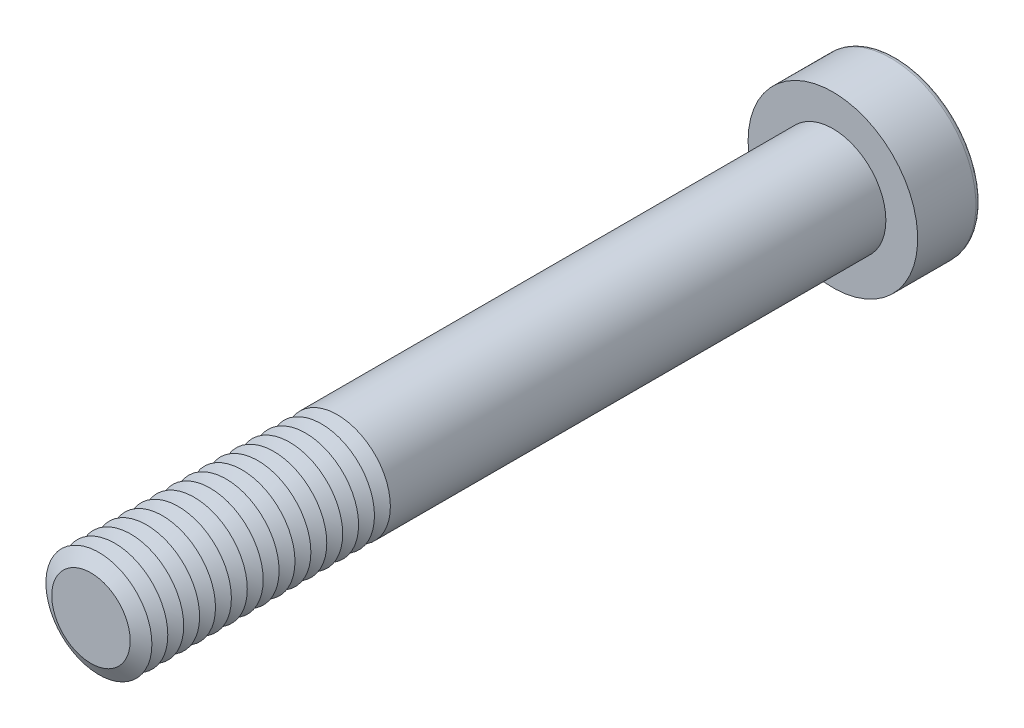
ISO-10303-21;
HEADER;
FILE_DESCRIPTION(('STEP AP214'),'2;1');
FILE_NAME('part.step','',(''),(''),'','','');
FILE_SCHEMA(('AUTOMOTIVE_DESIGN { 1 0 10303 214 1 1 1 1 }'));
ENDSEC;
DATA;
#1=APPLICATION_CONTEXT('core data for automotive mechanical design processes');
#2=APPLICATION_PROTOCOL_DEFINITION('international standard','automotive_design',2000,#1);
#3=PRODUCT_CONTEXT('',#1,'mechanical');
#4=PRODUCT('Part','Part','',(#3));
#5=PRODUCT_RELATED_PRODUCT_CATEGORY('part','',(#4));
#6=PRODUCT_DEFINITION_FORMATION('','',#4);
#7=PRODUCT_DEFINITION_CONTEXT('part definition',#1,'design');
#8=PRODUCT_DEFINITION('design','',#6,#7);
#9=PRODUCT_DEFINITION_SHAPE('','',#8);
#10=(LENGTH_UNIT() NAMED_UNIT(*) SI_UNIT(.MILLI.,.METRE.));
#11=(NAMED_UNIT(*) PLANE_ANGLE_UNIT() SI_UNIT($,.RADIAN.));
#12=(NAMED_UNIT(*) SI_UNIT($,.STERADIAN.) SOLID_ANGLE_UNIT());
#13=UNCERTAINTY_MEASURE_WITH_UNIT(LENGTH_MEASURE(1.E-05),#10,'distance_accuracy_value','');
#14=(GEOMETRIC_REPRESENTATION_CONTEXT(3) GLOBAL_UNCERTAINTY_ASSIGNED_CONTEXT((#13)) GLOBAL_UNIT_ASSIGNED_CONTEXT((#10,
#11,#12)) REPRESENTATION_CONTEXT('',''));
#15=CARTESIAN_POINT('',(0.,0.,0.));
#16=DIRECTION('',(0.,0.,1.));
#17=DIRECTION('',(1.,0.,0.));
#18=AXIS2_PLACEMENT_3D('',#15,#16,#17);
#19=CARTESIAN_POINT('',(0.,0.,64.75));
#20=DIRECTION('',(0.,0.,1.));
#21=DIRECTION('',(1.,0.,0.));
#22=AXIS2_PLACEMENT_3D('',#19,#20,#21);
#23=CONICAL_SURFACE('',#22,5.,1.0471975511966);
#24=CARTESIAN_POINT('',(0.,0.,64.));
#25=DIRECTION('',(0.,0.,1.));
#26=DIRECTION('',(1.,0.,0.));
#27=AXIS2_PLACEMENT_3D('',#24,#25,#26);
#28=CIRCLE('',#27,3.70096189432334);
#29=CARTESIAN_POINT('',(3.70096189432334,0.,64.));
#30=VERTEX_POINT('',#29);
#31=EDGE_CURVE('E313',#30,#30,#28,.T.);
#32=ORIENTED_EDGE('',*,*,#31,.T.);
#33=EDGE_LOOP('',(#32));
#34=FACE_BOUND('',#33,.T.);
#35=CARTESIAN_POINT('',(0.,0.,64.75));
#36=DIRECTION('',(0.,0.,1.));
#37=DIRECTION('',(1.,0.,0.));
#38=AXIS2_PLACEMENT_3D('',#35,#36,#37);
#39=CIRCLE('',#38,5.);
#40=CARTESIAN_POINT('',(5.,0.,64.75));
#41=VERTEX_POINT('',#40);
#42=EDGE_CURVE('E316',#41,#41,#39,.T.);
#43=ORIENTED_EDGE('',*,*,#42,.F.);
#44=EDGE_LOOP('',(#43));
#45=FACE_BOUND('',#44,.T.);
#46=ADVANCED_FACE('F39',(#34,#45),#23,.T.);
#47=CARTESIAN_POINT('',(0.,0.,64.));
#48=DIRECTION('',(0.,0.,-1.));
#49=DIRECTION('',(-1.,0.,0.));
#50=AXIS2_PLACEMENT_3D('',#47,#48,#49);
#51=CONICAL_SURFACE('',#50,3.70096189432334,1.0471975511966);
#52=CARTESIAN_POINT('',(0.,0.,63.25));
#53=DIRECTION('',(0.,0.,1.));
#54=DIRECTION('',(1.,0.,0.));
#55=AXIS2_PLACEMENT_3D('',#52,#53,#54);
#56=CIRCLE('',#55,5.);
#57=CARTESIAN_POINT('',(5.,0.,63.25));
#58=VERTEX_POINT('',#57);
#59=EDGE_CURVE('E324',#58,#58,#56,.T.);
#60=ORIENTED_EDGE('',*,*,#59,.T.);
#61=EDGE_LOOP('',(#60));
#62=FACE_BOUND('',#61,.T.);
#63=ORIENTED_EDGE('',*,*,#31,.F.);
#64=EDGE_LOOP('',(#63));
#65=FACE_BOUND('',#64,.T.);
#66=ADVANCED_FACE('F245',(#62,#65),#51,.T.);
#67=CARTESIAN_POINT('',(0.,0.,70.));
#68=DIRECTION('',(0.,0.,1.));
#69=DIRECTION('',(1.,0.,0.));
#70=AXIS2_PLACEMENT_3D('',#67,#68,#69);
#71=PLANE('',#70);
#72=CARTESIAN_POINT('',(0.,0.,70.));
#73=DIRECTION('',(0.,0.,1.));
#74=DIRECTION('',(1.,0.,0.));
#75=AXIS2_PLACEMENT_3D('',#72,#73,#74);
#76=CIRCLE('',#75,3.70096189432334);
#77=CARTESIAN_POINT('',(3.70096189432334,0.,70.));
#78=VERTEX_POINT('',#77);
#79=EDGE_CURVE('E174',#78,#78,#76,.T.);
#80=ORIENTED_EDGE('',*,*,#79,.T.);
#81=EDGE_LOOP('',(#80));
#82=FACE_BOUND('',#81,.T.);
#83=ADVANCED_FACE('F251',(#82),#71,.T.);
#84=CARTESIAN_POINT('',(0.,0.,70.));
#85=DIRECTION('',(0.,0.,-1.));
#86=DIRECTION('',(-1.,0.,0.));
#87=AXIS2_PLACEMENT_3D('',#84,#85,#86);
#88=CONICAL_SURFACE('',#87,3.70096189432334,1.0471975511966);
#89=CARTESIAN_POINT('',(0.,0.,69.25));
#90=DIRECTION('',(0.,0.,1.));
#91=DIRECTION('',(1.,0.,0.));
#92=AXIS2_PLACEMENT_3D('',#89,#90,#91);
#93=CIRCLE('',#92,5.);
#94=CARTESIAN_POINT('',(5.,0.,69.25));
#95=VERTEX_POINT('',#94);
#96=EDGE_CURVE('E291',#95,#95,#93,.T.);
#97=ORIENTED_EDGE('',*,*,#96,.T.);
#98=EDGE_LOOP('',(#97));
#99=FACE_BOUND('',#98,.T.);
#100=ORIENTED_EDGE('',*,*,#79,.F.);
#101=EDGE_LOOP('',(#100));
#102=FACE_BOUND('',#101,.T.);
#103=ADVANCED_FACE('F199',(#99,#102),#88,.T.);
#104=CARTESIAN_POINT('',(0.,0.,69.25));
#105=DIRECTION('',(0.,0.,1.));
#106=DIRECTION('',(1.,0.,0.));
#107=AXIS2_PLACEMENT_3D('',#104,#105,#106);
#108=CONICAL_SURFACE('',#107,5.,1.0471975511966);
#109=CARTESIAN_POINT('',(0.,0.,68.5));
#110=DIRECTION('',(0.,0.,1.));
#111=DIRECTION('',(1.,0.,0.));
#112=AXIS2_PLACEMENT_3D('',#109,#110,#111);
#113=CIRCLE('',#112,3.70096189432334);
#114=CARTESIAN_POINT('',(3.70096189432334,0.,68.5));
#115=VERTEX_POINT('',#114);
#116=EDGE_CURVE('E288',#115,#115,#113,.T.);
#117=ORIENTED_EDGE('',*,*,#116,.T.);
#118=EDGE_LOOP('',(#117));
#119=FACE_BOUND('',#118,.T.);
#120=ORIENTED_EDGE('',*,*,#96,.F.);
#121=EDGE_LOOP('',(#120));
#122=FACE_BOUND('',#121,.T.);
#123=ADVANCED_FACE('F277',(#119,#122),#108,.T.);
#124=CARTESIAN_POINT('',(0.,0.,68.5));
#125=DIRECTION('',(0.,0.,-1.));
#126=DIRECTION('',(-1.,0.,0.));
#127=AXIS2_PLACEMENT_3D('',#124,#125,#126);
#128=CONICAL_SURFACE('',#127,3.70096189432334,1.0471975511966);
#129=CARTESIAN_POINT('',(0.,0.,67.75));
#130=DIRECTION('',(0.,0.,1.));
#131=DIRECTION('',(1.,0.,0.));
#132=AXIS2_PLACEMENT_3D('',#129,#130,#131);
#133=CIRCLE('',#132,5.);
#134=CARTESIAN_POINT('',(5.,0.,67.75));
#135=VERTEX_POINT('',#134);
#136=EDGE_CURVE('E299',#135,#135,#133,.T.);
#137=ORIENTED_EDGE('',*,*,#136,.T.);
#138=EDGE_LOOP('',(#137));
#139=FACE_BOUND('',#138,.T.);
#140=ORIENTED_EDGE('',*,*,#116,.F.);
#141=EDGE_LOOP('',(#140));
#142=FACE_BOUND('',#141,.T.);
#143=ADVANCED_FACE('F274',(#139,#142),#128,.T.);
#144=CARTESIAN_POINT('',(0.,0.,67.75));
#145=DIRECTION('',(0.,0.,1.));
#146=DIRECTION('',(1.,0.,0.));
#147=AXIS2_PLACEMENT_3D('',#144,#145,#146);
#148=CONICAL_SURFACE('',#147,5.,1.0471975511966);
#149=CARTESIAN_POINT('',(0.,0.,67.));
#150=DIRECTION('',(0.,0.,1.));
#151=DIRECTION('',(1.,0.,0.));
#152=AXIS2_PLACEMENT_3D('',#149,#150,#151);
#153=CIRCLE('',#152,3.70096189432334);
#154=CARTESIAN_POINT('',(3.70096189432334,0.,67.));
#155=VERTEX_POINT('',#154);
#156=EDGE_CURVE('E293',#155,#155,#153,.T.);
#157=ORIENTED_EDGE('',*,*,#156,.T.);
#158=EDGE_LOOP('',(#157));
#159=FACE_BOUND('',#158,.T.);
#160=ORIENTED_EDGE('',*,*,#136,.F.);
#161=EDGE_LOOP('',(#160));
#162=FACE_BOUND('',#161,.T.);
#163=ADVANCED_FACE('F270',(#159,#162),#148,.T.);
#164=CARTESIAN_POINT('',(0.,0.,67.));
#165=DIRECTION('',(0.,0.,-1.));
#166=DIRECTION('',(-1.,0.,0.));
#167=AXIS2_PLACEMENT_3D('',#164,#165,#166);
#168=CONICAL_SURFACE('',#167,3.70096189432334,1.0471975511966);
#169=CARTESIAN_POINT('',(0.,0.,66.25));
#170=DIRECTION('',(0.,0.,1.));
#171=DIRECTION('',(1.,0.,0.));
#172=AXIS2_PLACEMENT_3D('',#169,#170,#171);
#173=CIRCLE('',#172,5.);
#174=CARTESIAN_POINT('',(5.,0.,66.25));
#175=VERTEX_POINT('',#174);
#176=EDGE_CURVE('E309',#175,#175,#173,.T.);
#177=ORIENTED_EDGE('',*,*,#176,.T.);
#178=EDGE_LOOP('',(#177));
#179=FACE_BOUND('',#178,.T.);
#180=ORIENTED_EDGE('',*,*,#156,.F.);
#181=EDGE_LOOP('',(#180));
#182=FACE_BOUND('',#181,.T.);
#183=ADVANCED_FACE('F266',(#179,#182),#168,.T.);
#184=CARTESIAN_POINT('',(0.,0.,66.25));
#185=DIRECTION('',(0.,0.,1.));
#186=DIRECTION('',(1.,0.,0.));
#187=AXIS2_PLACEMENT_3D('',#184,#185,#186);
#188=CONICAL_SURFACE('',#187,5.,1.0471975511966);
#189=CARTESIAN_POINT('',(0.,0.,65.5));
#190=DIRECTION('',(0.,0.,1.));
#191=DIRECTION('',(1.,0.,0.));
#192=AXIS2_PLACEMENT_3D('',#189,#190,#191);
#193=CIRCLE('',#192,3.70096189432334);
#194=CARTESIAN_POINT('',(3.70096189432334,0.,65.5));
#195=VERTEX_POINT('',#194);
#196=EDGE_CURVE('E305',#195,#195,#193,.T.);
#197=ORIENTED_EDGE('',*,*,#196,.T.);
#198=EDGE_LOOP('',(#197));
#199=FACE_BOUND('',#198,.T.);
#200=ORIENTED_EDGE('',*,*,#176,.F.);
#201=EDGE_LOOP('',(#200));
#202=FACE_BOUND('',#201,.T.);
#203=ADVANCED_FACE('F262',(#199,#202),#188,.T.);
#204=CARTESIAN_POINT('',(0.,0.,65.5));
#205=DIRECTION('',(0.,0.,-1.));
#206=DIRECTION('',(-1.,0.,0.));
#207=AXIS2_PLACEMENT_3D('',#204,#205,#206);
#208=CONICAL_SURFACE('',#207,3.70096189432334,1.0471975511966);
#209=ORIENTED_EDGE('',*,*,#42,.T.);
#210=EDGE_LOOP('',(#209));
#211=FACE_BOUND('',#210,.T.);
#212=ORIENTED_EDGE('',*,*,#196,.F.);
#213=EDGE_LOOP('',(#212));
#214=FACE_BOUND('',#213,.T.);
#215=ADVANCED_FACE('F258',(#211,#214),#208,.T.);
#216=CARTESIAN_POINT('',(0.,0.,63.25));
#217=DIRECTION('',(0.,0.,1.));
#218=DIRECTION('',(1.,0.,0.));
#219=AXIS2_PLACEMENT_3D('',#216,#217,#218);
#220=CONICAL_SURFACE('',#219,5.,1.0471975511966);
#221=CARTESIAN_POINT('',(0.,0.,62.5));
#222=DIRECTION('',(0.,0.,1.));
#223=DIRECTION('',(1.,0.,0.));
#224=AXIS2_PLACEMENT_3D('',#221,#222,#223);
#225=CIRCLE('',#224,3.70096189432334);
#226=CARTESIAN_POINT('',(3.70096189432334,0.,62.5));
#227=VERTEX_POINT('',#226);
#228=EDGE_CURVE('E320',#227,#227,#225,.T.);
#229=ORIENTED_EDGE('',*,*,#228,.T.);
#230=EDGE_LOOP('',(#229));
#231=FACE_BOUND('',#230,.T.);
#232=ORIENTED_EDGE('',*,*,#59,.F.);
#233=EDGE_LOOP('',(#232));
#234=FACE_BOUND('',#233,.T.);
#235=ADVANCED_FACE('F261',(#231,#234),#220,.T.);
#236=CARTESIAN_POINT('',(0.,0.,62.5));
#237=DIRECTION('',(0.,0.,-1.));
#238=DIRECTION('',(-1.,0.,0.));
#239=AXIS2_PLACEMENT_3D('',#236,#237,#238);
#240=CONICAL_SURFACE('',#239,3.70096189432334,1.0471975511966);
#241=CARTESIAN_POINT('',(0.,0.,61.75));
#242=DIRECTION('',(0.,0.,1.));
#243=DIRECTION('',(1.,0.,0.));
#244=AXIS2_PLACEMENT_3D('',#241,#242,#243);
#245=CIRCLE('',#244,5.);
#246=CARTESIAN_POINT('',(5.,0.,61.75));
#247=VERTEX_POINT('',#246);
#248=EDGE_CURVE('E332',#247,#247,#245,.T.);
#249=ORIENTED_EDGE('',*,*,#248,.T.);
#250=EDGE_LOOP('',(#249));
#251=FACE_BOUND('',#250,.T.);
#252=ORIENTED_EDGE('',*,*,#228,.F.);
#253=EDGE_LOOP('',(#252));
#254=FACE_BOUND('',#253,.T.);
#255=ADVANCED_FACE('F496',(#251,#254),#240,.T.);
#256=CARTESIAN_POINT('',(0.,0.,61.75));
#257=DIRECTION('',(0.,0.,1.));
#258=DIRECTION('',(1.,0.,0.));
#259=AXIS2_PLACEMENT_3D('',#256,#257,#258);
#260=CONICAL_SURFACE('',#259,5.,1.0471975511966);
#261=CARTESIAN_POINT('',(0.,0.,61.));
#262=DIRECTION('',(0.,0.,1.));
#263=DIRECTION('',(1.,0.,0.));
#264=AXIS2_PLACEMENT_3D('',#261,#262,#263);
#265=CIRCLE('',#264,3.70096189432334);
#266=CARTESIAN_POINT('',(3.70096189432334,0.,61.));
#267=VERTEX_POINT('',#266);
#268=EDGE_CURVE('E328',#267,#267,#265,.T.);
#269=ORIENTED_EDGE('',*,*,#268,.T.);
#270=EDGE_LOOP('',(#269));
#271=FACE_BOUND('',#270,.T.);
#272=ORIENTED_EDGE('',*,*,#248,.F.);
#273=EDGE_LOOP('',(#272));
#274=FACE_BOUND('',#273,.T.);
#275=ADVANCED_FACE('F492',(#271,#274),#260,.T.);
#276=CARTESIAN_POINT('',(0.,0.,61.));
#277=DIRECTION('',(0.,0.,-1.));
#278=DIRECTION('',(-1.,0.,0.));
#279=AXIS2_PLACEMENT_3D('',#276,#277,#278);
#280=CONICAL_SURFACE('',#279,3.70096189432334,1.0471975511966);
#281=CARTESIAN_POINT('',(0.,0.,60.25));
#282=DIRECTION('',(0.,0.,1.));
#283=DIRECTION('',(1.,0.,0.));
#284=AXIS2_PLACEMENT_3D('',#281,#282,#283);
#285=CIRCLE('',#284,5.);
#286=CARTESIAN_POINT('',(5.,0.,60.25));
#287=VERTEX_POINT('',#286);
#288=EDGE_CURVE('E340',#287,#287,#285,.T.);
#289=ORIENTED_EDGE('',*,*,#288,.T.);
#290=EDGE_LOOP('',(#289));
#291=FACE_BOUND('',#290,.T.);
#292=ORIENTED_EDGE('',*,*,#268,.F.);
#293=EDGE_LOOP('',(#292));
#294=FACE_BOUND('',#293,.T.);
#295=ADVANCED_FACE('F488',(#291,#294),#280,.T.);
#296=CARTESIAN_POINT('',(0.,0.,60.25));
#297=DIRECTION('',(0.,0.,1.));
#298=DIRECTION('',(1.,0.,0.));
#299=AXIS2_PLACEMENT_3D('',#296,#297,#298);
#300=CONICAL_SURFACE('',#299,5.,1.0471975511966);
#301=CARTESIAN_POINT('',(0.,0.,59.5));
#302=DIRECTION('',(0.,0.,1.));
#303=DIRECTION('',(1.,0.,0.));
#304=AXIS2_PLACEMENT_3D('',#301,#302,#303);
#305=CIRCLE('',#304,3.70096189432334);
#306=CARTESIAN_POINT('',(3.70096189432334,0.,59.5));
#307=VERTEX_POINT('',#306);
#308=EDGE_CURVE('E336',#307,#307,#305,.T.);
#309=ORIENTED_EDGE('',*,*,#308,.T.);
#310=EDGE_LOOP('',(#309));
#311=FACE_BOUND('',#310,.T.);
#312=ORIENTED_EDGE('',*,*,#288,.F.);
#313=EDGE_LOOP('',(#312));
#314=FACE_BOUND('',#313,.T.);
#315=ADVANCED_FACE('F484',(#311,#314),#300,.T.);
#316=CARTESIAN_POINT('',(0.,0.,59.5));
#317=DIRECTION('',(0.,0.,-1.));
#318=DIRECTION('',(-1.,0.,0.));
#319=AXIS2_PLACEMENT_3D('',#316,#317,#318);
#320=CONICAL_SURFACE('',#319,3.70096189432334,1.0471975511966);
#321=CARTESIAN_POINT('',(0.,0.,58.75));
#322=DIRECTION('',(0.,0.,1.));
#323=DIRECTION('',(1.,0.,0.));
#324=AXIS2_PLACEMENT_3D('',#321,#322,#323);
#325=CIRCLE('',#324,5.);
#326=CARTESIAN_POINT('',(5.,0.,58.75));
#327=VERTEX_POINT('',#326);
#328=EDGE_CURVE('E347',#327,#327,#325,.T.);
#329=ORIENTED_EDGE('',*,*,#328,.T.);
#330=EDGE_LOOP('',(#329));
#331=FACE_BOUND('',#330,.T.);
#332=ORIENTED_EDGE('',*,*,#308,.F.);
#333=EDGE_LOOP('',(#332));
#334=FACE_BOUND('',#333,.T.);
#335=ADVANCED_FACE('F480',(#331,#334),#320,.T.);
#336=CARTESIAN_POINT('',(0.,0.,58.75));
#337=DIRECTION('',(0.,0.,1.));
#338=DIRECTION('',(1.,0.,0.));
#339=AXIS2_PLACEMENT_3D('',#336,#337,#338);
#340=CONICAL_SURFACE('',#339,5.,1.0471975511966);
#341=CARTESIAN_POINT('',(0.,0.,58.));
#342=DIRECTION('',(0.,0.,1.));
#343=DIRECTION('',(1.,0.,0.));
#344=AXIS2_PLACEMENT_3D('',#341,#342,#343);
#345=CIRCLE('',#344,3.70096189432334);
#346=CARTESIAN_POINT('',(3.70096189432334,0.,58.));
#347=VERTEX_POINT('',#346);
#348=EDGE_CURVE('E344',#347,#347,#345,.T.);
#349=ORIENTED_EDGE('',*,*,#348,.T.);
#350=EDGE_LOOP('',(#349));
#351=FACE_BOUND('',#350,.T.);
#352=ORIENTED_EDGE('',*,*,#328,.F.);
#353=EDGE_LOOP('',(#352));
#354=FACE_BOUND('',#353,.T.);
#355=ADVANCED_FACE('F476',(#351,#354),#340,.T.);
#356=CARTESIAN_POINT('',(0.,0.,58.));
#357=DIRECTION('',(0.,0.,-1.));
#358=DIRECTION('',(-1.,0.,0.));
#359=AXIS2_PLACEMENT_3D('',#356,#357,#358);
#360=CONICAL_SURFACE('',#359,3.70096189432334,1.0471975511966);
#361=CARTESIAN_POINT('',(0.,0.,57.25));
#362=DIRECTION('',(0.,0.,1.));
#363=DIRECTION('',(1.,0.,0.));
#364=AXIS2_PLACEMENT_3D('',#361,#362,#363);
#365=CIRCLE('',#364,5.);
#366=CARTESIAN_POINT('',(5.,0.,57.25));
#367=VERTEX_POINT('',#366);
#368=EDGE_CURVE('E355',#367,#367,#365,.T.);
#369=ORIENTED_EDGE('',*,*,#368,.T.);
#370=EDGE_LOOP('',(#369));
#371=FACE_BOUND('',#370,.T.);
#372=ORIENTED_EDGE('',*,*,#348,.F.);
#373=EDGE_LOOP('',(#372));
#374=FACE_BOUND('',#373,.T.);
#375=ADVANCED_FACE('F472',(#371,#374),#360,.T.);
#376=CARTESIAN_POINT('',(0.,0.,57.25));
#377=DIRECTION('',(0.,0.,1.));
#378=DIRECTION('',(1.,0.,0.));
#379=AXIS2_PLACEMENT_3D('',#376,#377,#378);
#380=CONICAL_SURFACE('',#379,5.,1.0471975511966);
#381=CARTESIAN_POINT('',(0.,0.,56.5));
#382=DIRECTION('',(0.,0.,1.));
#383=DIRECTION('',(1.,0.,0.));
#384=AXIS2_PLACEMENT_3D('',#381,#382,#383);
#385=CIRCLE('',#384,3.70096189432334);
#386=CARTESIAN_POINT('',(3.70096189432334,0.,56.5));
#387=VERTEX_POINT('',#386);
#388=EDGE_CURVE('E351',#387,#387,#385,.T.);
#389=ORIENTED_EDGE('',*,*,#388,.T.);
#390=EDGE_LOOP('',(#389));
#391=FACE_BOUND('',#390,.T.);
#392=ORIENTED_EDGE('',*,*,#368,.F.);
#393=EDGE_LOOP('',(#392));
#394=FACE_BOUND('',#393,.T.);
#395=ADVANCED_FACE('F468',(#391,#394),#380,.T.);
#396=CARTESIAN_POINT('',(0.,0.,56.5));
#397=DIRECTION('',(0.,0.,-1.));
#398=DIRECTION('',(-1.,0.,0.));
#399=AXIS2_PLACEMENT_3D('',#396,#397,#398);
#400=CONICAL_SURFACE('',#399,3.70096189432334,1.0471975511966);
#401=CARTESIAN_POINT('',(0.,0.,55.75));
#402=DIRECTION('',(0.,0.,1.));
#403=DIRECTION('',(1.,0.,0.));
#404=AXIS2_PLACEMENT_3D('',#401,#402,#403);
#405=CIRCLE('',#404,5.);
#406=CARTESIAN_POINT('',(5.,0.,55.75));
#407=VERTEX_POINT('',#406);
#408=EDGE_CURVE('E363',#407,#407,#405,.T.);
#409=ORIENTED_EDGE('',*,*,#408,.T.);
#410=EDGE_LOOP('',(#409));
#411=FACE_BOUND('',#410,.T.);
#412=ORIENTED_EDGE('',*,*,#388,.F.);
#413=EDGE_LOOP('',(#412));
#414=FACE_BOUND('',#413,.T.);
#415=ADVANCED_FACE('F464',(#411,#414),#400,.T.);
#416=CARTESIAN_POINT('',(0.,0.,55.75));
#417=DIRECTION('',(0.,0.,1.));
#418=DIRECTION('',(1.,0.,0.));
#419=AXIS2_PLACEMENT_3D('',#416,#417,#418);
#420=CONICAL_SURFACE('',#419,5.,1.0471975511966);
#421=CARTESIAN_POINT('',(0.,0.,55.));
#422=DIRECTION('',(0.,0.,1.));
#423=DIRECTION('',(1.,0.,0.));
#424=AXIS2_PLACEMENT_3D('',#421,#422,#423);
#425=CIRCLE('',#424,3.70096189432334);
#426=CARTESIAN_POINT('',(3.70096189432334,0.,55.));
#427=VERTEX_POINT('',#426);
#428=EDGE_CURVE('E359',#427,#427,#425,.T.);
#429=ORIENTED_EDGE('',*,*,#428,.T.);
#430=EDGE_LOOP('',(#429));
#431=FACE_BOUND('',#430,.T.);
#432=ORIENTED_EDGE('',*,*,#408,.F.);
#433=EDGE_LOOP('',(#432));
#434=FACE_BOUND('',#433,.T.);
#435=ADVANCED_FACE('F460',(#431,#434),#420,.T.);
#436=CARTESIAN_POINT('',(0.,0.,55.));
#437=DIRECTION('',(0.,0.,-1.));
#438=DIRECTION('',(-1.,0.,0.));
#439=AXIS2_PLACEMENT_3D('',#436,#437,#438);
#440=CONICAL_SURFACE('',#439,3.70096189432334,1.0471975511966);
#441=CARTESIAN_POINT('',(0.,0.,54.25));
#442=DIRECTION('',(0.,0.,1.));
#443=DIRECTION('',(1.,0.,0.));
#444=AXIS2_PLACEMENT_3D('',#441,#442,#443);
#445=CIRCLE('',#444,5.);
#446=CARTESIAN_POINT('',(5.,0.,54.25));
#447=VERTEX_POINT('',#446);
#448=EDGE_CURVE('E371',#447,#447,#445,.T.);
#449=ORIENTED_EDGE('',*,*,#448,.T.);
#450=EDGE_LOOP('',(#449));
#451=FACE_BOUND('',#450,.T.);
#452=ORIENTED_EDGE('',*,*,#428,.F.);
#453=EDGE_LOOP('',(#452));
#454=FACE_BOUND('',#453,.T.);
#455=ADVANCED_FACE('F456',(#451,#454),#440,.T.);
#456=CARTESIAN_POINT('',(0.,0.,54.25));
#457=DIRECTION('',(0.,0.,1.));
#458=DIRECTION('',(1.,0.,0.));
#459=AXIS2_PLACEMENT_3D('',#456,#457,#458);
#460=CONICAL_SURFACE('',#459,5.,1.0471975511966);
#461=CARTESIAN_POINT('',(0.,0.,53.5));
#462=DIRECTION('',(0.,0.,1.));
#463=DIRECTION('',(1.,0.,0.));
#464=AXIS2_PLACEMENT_3D('',#461,#462,#463);
#465=CIRCLE('',#464,3.70096189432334);
#466=CARTESIAN_POINT('',(3.70096189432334,0.,53.5));
#467=VERTEX_POINT('',#466);
#468=EDGE_CURVE('E367',#467,#467,#465,.T.);
#469=ORIENTED_EDGE('',*,*,#468,.T.);
#470=EDGE_LOOP('',(#469));
#471=FACE_BOUND('',#470,.T.);
#472=ORIENTED_EDGE('',*,*,#448,.F.);
#473=EDGE_LOOP('',(#472));
#474=FACE_BOUND('',#473,.T.);
#475=ADVANCED_FACE('F452',(#471,#474),#460,.T.);
#476=CARTESIAN_POINT('',(0.,0.,53.5));
#477=DIRECTION('',(0.,0.,-1.));
#478=DIRECTION('',(-1.,0.,0.));
#479=AXIS2_PLACEMENT_3D('',#476,#477,#478);
#480=CONICAL_SURFACE('',#479,3.70096189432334,1.0471975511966);
#481=CARTESIAN_POINT('',(0.,0.,52.75));
#482=DIRECTION('',(0.,0.,1.));
#483=DIRECTION('',(1.,0.,0.));
#484=AXIS2_PLACEMENT_3D('',#481,#482,#483);
#485=CIRCLE('',#484,5.);
#486=CARTESIAN_POINT('',(5.,0.,52.75));
#487=VERTEX_POINT('',#486);
#488=EDGE_CURVE('E379',#487,#487,#485,.T.);
#489=ORIENTED_EDGE('',*,*,#488,.T.);
#490=EDGE_LOOP('',(#489));
#491=FACE_BOUND('',#490,.T.);
#492=ORIENTED_EDGE('',*,*,#468,.F.);
#493=EDGE_LOOP('',(#492));
#494=FACE_BOUND('',#493,.T.);
#495=ADVANCED_FACE('F448',(#491,#494),#480,.T.);
#496=CARTESIAN_POINT('',(0.,0.,52.75));
#497=DIRECTION('',(0.,0.,1.));
#498=DIRECTION('',(1.,0.,0.));
#499=AXIS2_PLACEMENT_3D('',#496,#497,#498);
#500=CONICAL_SURFACE('',#499,5.,1.0471975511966);
#501=CARTESIAN_POINT('',(0.,0.,52.));
#502=DIRECTION('',(0.,0.,1.));
#503=DIRECTION('',(1.,0.,0.));
#504=AXIS2_PLACEMENT_3D('',#501,#502,#503);
#505=CIRCLE('',#504,3.70096189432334);
#506=CARTESIAN_POINT('',(3.70096189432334,0.,52.));
#507=VERTEX_POINT('',#506);
#508=EDGE_CURVE('E375',#507,#507,#505,.T.);
#509=ORIENTED_EDGE('',*,*,#508,.T.);
#510=EDGE_LOOP('',(#509));
#511=FACE_BOUND('',#510,.T.);
#512=ORIENTED_EDGE('',*,*,#488,.F.);
#513=EDGE_LOOP('',(#512));
#514=FACE_BOUND('',#513,.T.);
#515=ADVANCED_FACE('F444',(#511,#514),#500,.T.);
#516=CARTESIAN_POINT('',(0.,0.,52.));
#517=DIRECTION('',(0.,0.,-1.));
#518=DIRECTION('',(-1.,0.,0.));
#519=AXIS2_PLACEMENT_3D('',#516,#517,#518);
#520=CONICAL_SURFACE('',#519,3.70096189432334,1.0471975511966);
#521=CARTESIAN_POINT('',(0.,0.,51.25));
#522=DIRECTION('',(0.,0.,1.));
#523=DIRECTION('',(1.,0.,0.));
#524=AXIS2_PLACEMENT_3D('',#521,#522,#523);
#525=CIRCLE('',#524,5.);
#526=CARTESIAN_POINT('',(5.,0.,51.25));
#527=VERTEX_POINT('',#526);
#528=EDGE_CURVE('E387',#527,#527,#525,.T.);
#529=ORIENTED_EDGE('',*,*,#528,.T.);
#530=EDGE_LOOP('',(#529));
#531=FACE_BOUND('',#530,.T.);
#532=ORIENTED_EDGE('',*,*,#508,.F.);
#533=EDGE_LOOP('',(#532));
#534=FACE_BOUND('',#533,.T.);
#535=ADVANCED_FACE('F440',(#531,#534),#520,.T.);
#536=CARTESIAN_POINT('',(0.,0.,51.25));
#537=DIRECTION('',(0.,0.,1.));
#538=DIRECTION('',(1.,0.,0.));
#539=AXIS2_PLACEMENT_3D('',#536,#537,#538);
#540=CONICAL_SURFACE('',#539,5.,1.0471975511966);
#541=CARTESIAN_POINT('',(0.,0.,50.5));
#542=DIRECTION('',(0.,0.,1.));
#543=DIRECTION('',(1.,0.,0.));
#544=AXIS2_PLACEMENT_3D('',#541,#542,#543);
#545=CIRCLE('',#544,3.70096189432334);
#546=CARTESIAN_POINT('',(3.70096189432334,0.,50.5));
#547=VERTEX_POINT('',#546);
#548=EDGE_CURVE('E383',#547,#547,#545,.T.);
#549=ORIENTED_EDGE('',*,*,#548,.T.);
#550=EDGE_LOOP('',(#549));
#551=FACE_BOUND('',#550,.T.);
#552=ORIENTED_EDGE('',*,*,#528,.F.);
#553=EDGE_LOOP('',(#552));
#554=FACE_BOUND('',#553,.T.);
#555=ADVANCED_FACE('F436',(#551,#554),#540,.T.);
#556=CARTESIAN_POINT('',(0.,0.,50.5));
#557=DIRECTION('',(0.,0.,-1.));
#558=DIRECTION('',(-1.,0.,0.));
#559=AXIS2_PLACEMENT_3D('',#556,#557,#558);
#560=CONICAL_SURFACE('',#559,3.70096189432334,1.0471975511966);
#561=CARTESIAN_POINT('',(0.,0.,49.75));
#562=DIRECTION('',(0.,0.,1.));
#563=DIRECTION('',(1.,0.,0.));
#564=AXIS2_PLACEMENT_3D('',#561,#562,#563);
#565=CIRCLE('',#564,5.);
#566=CARTESIAN_POINT('',(5.,0.,49.75));
#567=VERTEX_POINT('',#566);
#568=EDGE_CURVE('E395',#567,#567,#565,.T.);
#569=ORIENTED_EDGE('',*,*,#568,.T.);
#570=EDGE_LOOP('',(#569));
#571=FACE_BOUND('',#570,.T.);
#572=ORIENTED_EDGE('',*,*,#548,.F.);
#573=EDGE_LOOP('',(#572));
#574=FACE_BOUND('',#573,.T.);
#575=ADVANCED_FACE('F432',(#571,#574),#560,.T.);
#576=CARTESIAN_POINT('',(0.,0.,49.75));
#577=DIRECTION('',(0.,0.,1.));
#578=DIRECTION('',(1.,0.,0.));
#579=AXIS2_PLACEMENT_3D('',#576,#577,#578);
#580=CONICAL_SURFACE('',#579,5.,1.0471975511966);
#581=CARTESIAN_POINT('',(0.,0.,49.));
#582=DIRECTION('',(0.,0.,1.));
#583=DIRECTION('',(1.,0.,0.));
#584=AXIS2_PLACEMENT_3D('',#581,#582,#583);
#585=CIRCLE('',#584,3.70096189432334);
#586=CARTESIAN_POINT('',(3.70096189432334,0.,49.));
#587=VERTEX_POINT('',#586);
#588=EDGE_CURVE('E391',#587,#587,#585,.T.);
#589=ORIENTED_EDGE('',*,*,#588,.T.);
#590=EDGE_LOOP('',(#589));
#591=FACE_BOUND('',#590,.T.);
#592=ORIENTED_EDGE('',*,*,#568,.F.);
#593=EDGE_LOOP('',(#592));
#594=FACE_BOUND('',#593,.T.);
#595=ADVANCED_FACE('F427',(#591,#594),#580,.T.);
#596=CARTESIAN_POINT('',(0.,0.,49.));
#597=DIRECTION('',(0.,0.,-1.));
#598=DIRECTION('',(-1.,0.,0.));
#599=AXIS2_PLACEMENT_3D('',#596,#597,#598);
#600=CONICAL_SURFACE('',#599,3.70096189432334,1.0471975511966);
#601=CARTESIAN_POINT('',(0.,0.,48.25));
#602=DIRECTION('',(0.,0.,1.));
#603=DIRECTION('',(1.,0.,0.));
#604=AXIS2_PLACEMENT_3D('',#601,#602,#603);
#605=CIRCLE('',#604,5.);
#606=CARTESIAN_POINT('',(5.,0.,48.25));
#607=VERTEX_POINT('',#606);
#608=EDGE_CURVE('E407',#607,#607,#605,.T.);
#609=ORIENTED_EDGE('',*,*,#608,.T.);
#610=EDGE_LOOP('',(#609));
#611=FACE_BOUND('',#610,.T.);
#612=ORIENTED_EDGE('',*,*,#588,.F.);
#613=EDGE_LOOP('',(#612));
#614=FACE_BOUND('',#613,.T.);
#615=ADVANCED_FACE('F413',(#611,#614),#600,.T.);
#616=CARTESIAN_POINT('',(0.,0.,48.25));
#617=DIRECTION('',(0.,0.,1.));
#618=DIRECTION('',(1.,0.,0.));
#619=AXIS2_PLACEMENT_3D('',#616,#617,#618);
#620=CONICAL_SURFACE('',#619,5.,1.0471975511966);
#621=CARTESIAN_POINT('',(0.,0.,47.5));
#622=DIRECTION('',(0.,0.,1.));
#623=DIRECTION('',(1.,0.,0.));
#624=AXIS2_PLACEMENT_3D('',#621,#622,#623);
#625=CIRCLE('',#624,3.70096189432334);
#626=CARTESIAN_POINT('',(3.70096189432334,0.,47.5));
#627=VERTEX_POINT('',#626);
#628=EDGE_CURVE('E399',#627,#627,#625,.T.);
#629=ORIENTED_EDGE('',*,*,#628,.T.);
#630=EDGE_LOOP('',(#629));
#631=FACE_BOUND('',#630,.T.);
#632=ORIENTED_EDGE('',*,*,#608,.F.);
#633=EDGE_LOOP('',(#632));
#634=FACE_BOUND('',#633,.T.);
#635=ADVANCED_FACE('F416',(#631,#634),#620,.T.);
#636=CARTESIAN_POINT('',(0.,0.,47.5));
#637=DIRECTION('',(0.,0.,-1.));
#638=DIRECTION('',(-1.,0.,0.));
#639=AXIS2_PLACEMENT_3D('',#636,#637,#638);
#640=CONICAL_SURFACE('',#639,3.70096189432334,1.0471975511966);
#641=CARTESIAN_POINT('',(0.,0.,46.75));
#642=DIRECTION('',(0.,0.,1.));
#643=DIRECTION('',(1.,0.,0.));
#644=AXIS2_PLACEMENT_3D('',#641,#642,#643);
#645=CIRCLE('',#644,5.);
#646=CARTESIAN_POINT('',(5.,0.,46.75));
#647=VERTEX_POINT('',#646);
#648=EDGE_CURVE('E403',#647,#647,#645,.T.);
#649=ORIENTED_EDGE('',*,*,#648,.T.);
#650=EDGE_LOOP('',(#649));
#651=FACE_BOUND('',#650,.T.);
#652=ORIENTED_EDGE('',*,*,#628,.F.);
#653=EDGE_LOOP('',(#652));
#654=FACE_BOUND('',#653,.T.);
#655=ADVANCED_FACE('F418',(#651,#654),#640,.T.);
#656=CARTESIAN_POINT('',(0.,0.,-0.75));
#657=DIRECTION('',(0.,0.,-1.));
#658=DIRECTION('',(-1.,0.,0.));
#659=AXIS2_PLACEMENT_3D('',#656,#657,#658);
#660=CONICAL_SURFACE('',#659,3.5,1.0471975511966);
#661=CARTESIAN_POINT('',(0.,0.,1.27072594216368));
#662=VERTEX_POINT('',#661);
#663=VERTEX_LOOP('',#662);
#664=FACE_BOUND('',#663,.T.);
#665=CARTESIAN_POINT('',(0.,0.,-0.75));
#666=DIRECTION('',(0.,0.,-1.));
#667=DIRECTION('',(-1.,0.,0.));
#668=AXIS2_PLACEMENT_3D('',#665,#666,#667);
#669=CIRCLE('',#668,3.5);
#670=CARTESIAN_POINT('',(-3.03108891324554,1.75,-0.75));
#671=VERTEX_POINT('',#670);
#672=CARTESIAN_POINT('',(0.,3.5,-0.75));
#673=VERTEX_POINT('',#672);
#674=EDGE_CURVE('E149',#671,#673,#669,.T.);
#675=ORIENTED_EDGE('',*,*,#674,.T.);
#676=CARTESIAN_POINT('',(0.,0.,-0.75));
#677=DIRECTION('',(0.,0.,-1.));
#678=DIRECTION('',(-1.,0.,0.));
#679=AXIS2_PLACEMENT_3D('',#676,#677,#678);
#680=CIRCLE('',#679,3.5);
#681=CARTESIAN_POINT('',(3.03108891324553,1.75,-0.75));
#682=VERTEX_POINT('',#681);
#683=EDGE_CURVE('E54',#673,#682,#680,.T.);
#684=ORIENTED_EDGE('',*,*,#683,.T.);
#685=CARTESIAN_POINT('',(3.03108891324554,-1.75,-0.75));
#686=VERTEX_POINT('',#685);
#687=EDGE_CURVE('E996',#682,#686,#680,.T.);
#688=ORIENTED_EDGE('',*,*,#687,.T.);
#689=CARTESIAN_POINT('',(0.,-3.5,-0.75));
#690=VERTEX_POINT('',#689);
#691=EDGE_CURVE('E995',#686,#690,#680,.T.);
#692=ORIENTED_EDGE('',*,*,#691,.T.);
#693=CARTESIAN_POINT('',(-3.03108891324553,-1.75,-0.75));
#694=VERTEX_POINT('',#693);
#695=EDGE_CURVE('E990',#690,#694,#680,.T.);
#696=ORIENTED_EDGE('',*,*,#695,.T.);
#697=EDGE_CURVE('E988',#694,#671,#680,.T.);
#698=ORIENTED_EDGE('',*,*,#697,.T.);
#699=EDGE_LOOP('',(#675,#684,#688,#692,#696,#698));
#700=FACE_BOUND('',#699,.T.);
#701=ADVANCED_FACE('F201',(#664,#700),#660,.F.);
#702=CARTESIAN_POINT('',(0.,0.,-0.75));
#703=DIRECTION('',(0.,0.,-1.));
#704=DIRECTION('',(-1.,0.,0.));
#705=AXIS2_PLACEMENT_3D('',#702,#703,#704);
#706=PLANE('',#705);
#707=ORIENTED_EDGE('',*,*,#683,.F.);
#708=DIRECTION('',(1.,0.,0.));
#709=VECTOR('',#708,1.);
#710=CARTESIAN_POINT('',(-2.02072594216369,3.5,-0.75));
#711=LINE('',#710,#709);
#712=CARTESIAN_POINT('',(2.02072594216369,3.5,-0.75));
#713=VERTEX_POINT('',#712);
#714=EDGE_CURVE('E1038',#673,#713,#711,.T.);
#715=ORIENTED_EDGE('',*,*,#714,.T.);
#716=DIRECTION('',(0.5,-0.866025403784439,0.));
#717=VECTOR('',#716,1.);
#718=CARTESIAN_POINT('',(2.02072594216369,3.5,-0.75));
#719=LINE('',#718,#717);
#720=EDGE_CURVE('E155',#713,#682,#719,.T.);
#721=ORIENTED_EDGE('',*,*,#720,.T.);
#722=EDGE_LOOP('',(#707,#715,#721));
#723=FACE_BOUND('',#722,.T.);
#724=ADVANCED_FACE('F585',(#723),#706,.T.);
#725=ORIENTED_EDGE('',*,*,#687,.F.);
#726=CARTESIAN_POINT('',(4.04145188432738,0.,-0.75));
#727=VERTEX_POINT('',#726);
#728=EDGE_CURVE('E1034',#682,#727,#719,.T.);
#729=ORIENTED_EDGE('',*,*,#728,.T.);
#730=DIRECTION('',(-0.5,-0.866025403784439,0.));
#731=VECTOR('',#730,1.);
#732=CARTESIAN_POINT('',(4.04145188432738,0.,-0.75));
#733=LINE('',#732,#731);
#734=EDGE_CURVE('E1011',#727,#686,#733,.T.);
#735=ORIENTED_EDGE('',*,*,#734,.T.);
#736=EDGE_LOOP('',(#725,#729,#735));
#737=FACE_BOUND('',#736,.T.);
#738=ADVANCED_FACE('F595',(#737),#706,.T.);
#739=ORIENTED_EDGE('',*,*,#691,.F.);
#740=CARTESIAN_POINT('',(2.02072594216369,-3.5,-0.75));
#741=VERTEX_POINT('',#740);
#742=EDGE_CURVE('E1013',#686,#741,#733,.T.);
#743=ORIENTED_EDGE('',*,*,#742,.T.);
#744=DIRECTION('',(-1.,0.,0.));
#745=VECTOR('',#744,1.);
#746=CARTESIAN_POINT('',(2.02072594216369,-3.5,-0.75));
#747=LINE('',#746,#745);
#748=EDGE_CURVE('E962',#741,#690,#747,.T.);
#749=ORIENTED_EDGE('',*,*,#748,.T.);
#750=EDGE_LOOP('',(#739,#743,#749));
#751=FACE_BOUND('',#750,.T.);
#752=ADVANCED_FACE('F605',(#751),#706,.T.);
#753=ORIENTED_EDGE('',*,*,#695,.F.);
#754=CARTESIAN_POINT('',(-2.02072594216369,-3.5,-0.75));
#755=VERTEX_POINT('',#754);
#756=EDGE_CURVE('E1007',#690,#755,#747,.T.);
#757=ORIENTED_EDGE('',*,*,#756,.T.);
#758=DIRECTION('',(-0.5,0.866025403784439,0.));
#759=VECTOR('',#758,1.);
#760=CARTESIAN_POINT('',(-2.02072594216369,-3.5,-0.75));
#761=LINE('',#760,#759);
#762=EDGE_CURVE('E1009',#755,#694,#761,.T.);
#763=ORIENTED_EDGE('',*,*,#762,.T.);
#764=EDGE_LOOP('',(#753,#757,#763));
#765=FACE_BOUND('',#764,.T.);
#766=ADVANCED_FACE('F613',(#765),#706,.T.);
#767=ORIENTED_EDGE('',*,*,#697,.F.);
#768=CARTESIAN_POINT('',(-4.04145188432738,0.,-0.75));
#769=VERTEX_POINT('',#768);
#770=EDGE_CURVE('E1014',#694,#769,#761,.T.);
#771=ORIENTED_EDGE('',*,*,#770,.T.);
#772=DIRECTION('',(0.5,0.866025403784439,0.));
#773=VECTOR('',#772,1.);
#774=CARTESIAN_POINT('',(-4.04145188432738,0.,-0.75));
#775=LINE('',#774,#773);
#776=EDGE_CURVE('E158',#769,#671,#775,.T.);
#777=ORIENTED_EDGE('',*,*,#776,.T.);
#778=EDGE_LOOP('',(#767,#771,#777));
#779=FACE_BOUND('',#778,.T.);
#780=ADVANCED_FACE('F231',(#779),#706,.T.);
#781=ORIENTED_EDGE('',*,*,#674,.F.);
#782=CARTESIAN_POINT('',(-2.02072594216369,3.5,-0.75));
#783=VERTEX_POINT('',#782);
#784=EDGE_CURVE('E1021',#671,#783,#775,.T.);
#785=ORIENTED_EDGE('',*,*,#784,.T.);
#786=EDGE_CURVE('E1035',#783,#673,#711,.T.);
#787=ORIENTED_EDGE('',*,*,#786,.T.);
#788=EDGE_LOOP('',(#781,#785,#787));
#789=FACE_BOUND('',#788,.T.);
#790=ADVANCED_FACE('F597',(#789),#706,.T.);
#791=CARTESIAN_POINT('',(-2.02072594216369,3.5,-0.75));
#792=DIRECTION('',(0.,1.,0.));
#793=DIRECTION('',(-1.,0.,0.));
#794=AXIS2_PLACEMENT_3D('',#791,#792,#793);
#795=PLANE('',#794);
#796=DIRECTION('',(0.,0.,-1.));
#797=VECTOR('',#796,1.);
#798=CARTESIAN_POINT('',(-2.02072594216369,3.5,-0.75));
#799=LINE('',#798,#797);
#800=CARTESIAN_POINT('',(-2.02072594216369,3.5,-6.));
#801=VERTEX_POINT('',#800);
#802=EDGE_CURVE('E147',#783,#801,#799,.T.);
#803=ORIENTED_EDGE('',*,*,#802,.T.);
#804=CARTESIAN_POINT('',(-5.27521327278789,3.5,-6.613404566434));
#805=CARTESIAN_POINT('',(-5.11717138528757,3.5,-6.57812703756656));
#806=CARTESIAN_POINT('',(-4.95902873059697,3.5,-6.5432936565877));
#807=CARTESIAN_POINT('',(-4.64249233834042,3.5,-6.47475322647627));
#808=CARTESIAN_POINT('',(-4.48409858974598,3.5,-6.44104622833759));
#809=CARTESIAN_POINT('',(-4.16686075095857,3.5,-6.37496567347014));
#810=CARTESIAN_POINT('',(-4.00801636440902,3.5,-6.34259353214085));
#811=CARTESIAN_POINT('',(-3.68999232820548,3.5,-6.27954992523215));
#812=CARTESIAN_POINT('',(-3.53081268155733,3.5,-6.24887844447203));
#813=CARTESIAN_POINT('',(-3.05545711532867,3.5,-6.16049717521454));
#814=CARTESIAN_POINT('',(-2.73870333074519,3.5,-6.10583257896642));
#815=CARTESIAN_POINT('',(-2.10326379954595,3.5,-6.00899390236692));
#816=CARTESIAN_POINT('',(-1.78457845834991,3.5,-5.9668172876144));
#817=CARTESIAN_POINT('',(-1.30331397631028,3.5,-5.91703310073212));
#818=CARTESIAN_POINT('',(-1.14143900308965,3.5,-5.90264327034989));
#819=CARTESIAN_POINT('',(-0.817296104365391,3.5,-5.87924021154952));
#820=CARTESIAN_POINT('',(-0.655028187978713,3.5,-5.87022685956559));
#821=CARTESIAN_POINT('',(-0.330337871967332,3.5,-5.8581019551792));
#822=CARTESIAN_POINT('',(-0.167915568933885,3.5,-5.85498786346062));
#823=CARTESIAN_POINT('',(0.156931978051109,3.5,-5.85485125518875));
#824=CARTESIAN_POINT('',(0.319357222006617,3.5,-5.8578287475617));
#825=CARTESIAN_POINT('',(0.644649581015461,3.5,-5.86971076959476));
#826=CARTESIAN_POINT('',(0.807515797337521,3.5,-5.87863941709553));
#827=CARTESIAN_POINT('',(1.13286152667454,3.5,-5.90192432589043));
#828=CARTESIAN_POINT('',(1.29534101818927,3.5,-5.91628088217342));
#829=CARTESIAN_POINT('',(1.61990955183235,3.5,-5.94971371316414));
#830=CARTESIAN_POINT('',(1.78199828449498,3.5,-5.96879294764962));
#831=CARTESIAN_POINT('',(2.10565606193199,3.5,-6.01089893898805));
#832=CARTESIAN_POINT('',(2.26722510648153,3.5,-6.03392569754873));
#833=CARTESIAN_POINT('',(2.59408673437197,3.5,-6.08385328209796));
#834=CARTESIAN_POINT('',(2.75936612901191,3.5,-6.11083971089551));
#835=CARTESIAN_POINT('',(3.08945524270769,3.5,-6.16755337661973));
#836=CARTESIAN_POINT('',(3.25426494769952,3.5,-6.19728069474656));
#837=CARTESIAN_POINT('',(3.74811783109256,3.5,-6.28973245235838));
#838=CARTESIAN_POINT('',(4.07654810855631,3.5,-6.35572082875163));
#839=CARTESIAN_POINT('',(4.73230999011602,3.5,-6.49329874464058));
#840=CARTESIAN_POINT('',(5.05964125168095,3.5,-6.56488988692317));
#841=CARTESIAN_POINT('',(5.71347161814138,3.5,-6.71179760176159));
#842=CARTESIAN_POINT('',(6.03997070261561,3.5,-6.78711426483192));
#843=CARTESIAN_POINT('',(6.68838444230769,3.5,-6.93936666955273));
#844=CARTESIAN_POINT('',(7.01030641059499,3.5,-7.01627142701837));
#845=CARTESIAN_POINT('',(7.65372712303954,3.5,-7.17185944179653));
#846=CARTESIAN_POINT('',(7.97522585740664,3.5,-7.25054273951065));
#847=CARTESIAN_POINT('',(8.61745492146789,3.5,-7.409094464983));
#848=CARTESIAN_POINT('',(8.93818569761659,3.5,-7.48896108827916));
#849=CARTESIAN_POINT('',(9.57938765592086,3.5,-7.64968154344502));
#850=CARTESIAN_POINT('',(9.89985884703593,3.5,-7.73053533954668));
#851=CARTESIAN_POINT('',(10.2202418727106,3.5,-7.81173318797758));
#852=B_SPLINE_CURVE_WITH_KNOTS('',3,(#804,#805,#806,#807,#808,#809,#810,#811,#812,#813,#814,
#815,#816,#817,#818,#819,#820,#821,#822,#823,#824,#825,#826,#827,#828,#829,#830,#831,#832,#833,
#834,#835,#836,#837,#838,#839,#840,#841,#842,#843,#844,#845,#846,#847,#848,#849,#850,#851),
.UNSPECIFIED.,.F.,.F.,(4,2,2,2,2,2,2,2,2,2,2,2,2,2,2,2,2,2,2,2,2,2,2,4),(0.,0.485795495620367,
0.971612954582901,1.45793295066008,1.94424860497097,2.90841266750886,3.87238092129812,
4.35984584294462,4.84729956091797,5.33454340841,5.82178796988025,6.31101925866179,
6.80027713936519,7.28984242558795,7.77940792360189,8.28178329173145,8.78417354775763,
9.78906542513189,10.7942458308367,11.7994506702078,12.7923858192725,13.7853435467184,
14.7769174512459,15.7684555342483),.UNSPECIFIED.);
#853=CARTESIAN_POINT('',(2.02072594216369,3.5,-6.));
#854=VERTEX_POINT('',#853);
#855=EDGE_CURVE('E124',#801,#854,#852,.T.);
#856=ORIENTED_EDGE('',*,*,#855,.T.);
#857=DIRECTION('',(0.,0.,-1.));
#858=VECTOR('',#857,1.);
#859=CARTESIAN_POINT('',(2.02072594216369,3.5,-0.75));
#860=LINE('',#859,#858);
#861=EDGE_CURVE('E143',#713,#854,#860,.T.);
#862=ORIENTED_EDGE('',*,*,#861,.F.);
#863=ORIENTED_EDGE('',*,*,#714,.F.);
#864=ORIENTED_EDGE('',*,*,#786,.F.);
#865=EDGE_LOOP('',(#803,#856,#862,#863,#864));
#866=FACE_BOUND('',#865,.T.);
#867=ADVANCED_FACE('F141',(#866),#795,.F.);
#868=CARTESIAN_POINT('',(2.02072594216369,3.5,-0.75));
#869=DIRECTION('',(0.866025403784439,0.5,0.));
#870=DIRECTION('',(-0.5,0.866025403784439,0.));
#871=AXIS2_PLACEMENT_3D('',#868,#869,#870);
#872=PLANE('',#871);
#873=ORIENTED_EDGE('',*,*,#861,.T.);
#874=CARTESIAN_POINT('',(2.02061047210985,3.5002,-6.00003094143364));
#875=CARTESIAN_POINT('',(2.10453570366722,3.35483723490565,-5.97753281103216));
#876=CARTESIAN_POINT('',(2.18861311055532,3.20921089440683,-5.95710815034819));
#877=CARTESIAN_POINT('',(2.35706487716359,2.91744387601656,-5.92122385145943));
#878=CARTESIAN_POINT('',(2.44143934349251,2.77130301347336,-5.90576623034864));
#879=CARTESIAN_POINT('',(2.6099736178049,2.47939308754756,-5.88071849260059));
#880=CARTESIAN_POINT('',(2.69413228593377,2.33362599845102,-5.87109850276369));
#881=CARTESIAN_POINT('',(2.86255695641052,2.04190591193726,-5.85819907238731));
#882=CARTESIAN_POINT('',(2.94682293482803,1.89595295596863,-5.85491840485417));
#883=CARTESIAN_POINT('',(3.11535489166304,1.60404704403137,-5.85491840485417));
#884=CARTESIAN_POINT('',(3.19962087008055,1.45809408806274,-5.85819907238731));
#885=CARTESIAN_POINT('',(3.3680455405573,1.16637400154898,-5.87109850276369));
#886=CARTESIAN_POINT('',(3.45220420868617,1.02060691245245,-5.88071849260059));
#887=CARTESIAN_POINT('',(3.62073848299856,0.728696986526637,-5.90576623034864));
#888=CARTESIAN_POINT('',(3.70511294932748,0.582556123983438,-5.92122385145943));
#889=CARTESIAN_POINT('',(3.87356471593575,0.290789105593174,-5.95710815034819));
#890=CARTESIAN_POINT('',(3.95764212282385,0.145162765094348,-5.97753281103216));
#891=CARTESIAN_POINT('',(4.04156735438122,-0.000199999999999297,-6.00003094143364));
#892=B_SPLINE_CURVE_WITH_KNOTS('',3,(#874,#875,#876,#877,#878,#879,#880,#881,#882,#883,#884,
#885,#886,#887,#888,#889,#890,#891),.UNSPECIFIED.,.F.,.F.,(4,2,2,2,2,2,2,2,4),(0.,
0.508081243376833,1.01636855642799,1.52203235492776,2.02759827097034,2.53316418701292,
3.03882798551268,3.54711529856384,4.05519654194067),.UNSPECIFIED.);
#893=CARTESIAN_POINT('',(4.04145188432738,0.,-6.));
#894=VERTEX_POINT('',#893);
#895=EDGE_CURVE('E11',#854,#894,#892,.T.);
#896=ORIENTED_EDGE('',*,*,#895,.T.);
#897=DIRECTION('',(0.,0.,-1.));
#898=VECTOR('',#897,1.);
#899=CARTESIAN_POINT('',(4.04145188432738,0.,-0.75));
#900=LINE('',#899,#898);
#901=EDGE_CURVE('E157',#727,#894,#900,.T.);
#902=ORIENTED_EDGE('',*,*,#901,.F.);
#903=ORIENTED_EDGE('',*,*,#728,.F.);
#904=ORIENTED_EDGE('',*,*,#720,.F.);
#905=EDGE_LOOP('',(#873,#896,#902,#903,#904));
#906=FACE_BOUND('',#905,.T.);
#907=ADVANCED_FACE('F152',(#906),#872,.F.);
#908=CARTESIAN_POINT('',(4.04145188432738,0.,-0.75));
#909=DIRECTION('',(0.866025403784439,-0.5,0.));
#910=DIRECTION('',(0.5,0.866025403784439,0.));
#911=AXIS2_PLACEMENT_3D('',#908,#909,#910);
#912=PLANE('',#911);
#913=ORIENTED_EDGE('',*,*,#901,.T.);
#914=CARTESIAN_POINT('',(4.04156735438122,0.000200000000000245,-6.00003094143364));
#915=CARTESIAN_POINT('',(3.95764212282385,-0.145162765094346,-5.97753281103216));
#916=CARTESIAN_POINT('',(3.87356471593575,-0.290789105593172,-5.95710815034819));
#917=CARTESIAN_POINT('',(3.70511294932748,-0.582556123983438,-5.92122385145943));
#918=CARTESIAN_POINT('',(3.62073848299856,-0.728696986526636,-5.90576623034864));
#919=CARTESIAN_POINT('',(3.45220420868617,-1.02060691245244,-5.88071849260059));
#920=CARTESIAN_POINT('',(3.3680455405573,-1.16637400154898,-5.87109850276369));
#921=CARTESIAN_POINT('',(3.19962087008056,-1.45809408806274,-5.85819907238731));
#922=CARTESIAN_POINT('',(3.11535489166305,-1.60404704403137,-5.85491840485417));
#923=CARTESIAN_POINT('',(2.94682293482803,-1.89595295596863,-5.85491840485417));
#924=CARTESIAN_POINT('',(2.86255695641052,-2.04190591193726,-5.85819907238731));
#925=CARTESIAN_POINT('',(2.69413228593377,-2.33362599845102,-5.87109850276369));
#926=CARTESIAN_POINT('',(2.6099736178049,-2.47939308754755,-5.88071849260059));
#927=CARTESIAN_POINT('',(2.44143934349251,-2.77130301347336,-5.90576623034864));
#928=CARTESIAN_POINT('',(2.35706487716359,-2.91744387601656,-5.92122385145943));
#929=CARTESIAN_POINT('',(2.18861311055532,-3.20921089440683,-5.95710815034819));
#930=CARTESIAN_POINT('',(2.10453570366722,-3.35483723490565,-5.97753281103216));
#931=CARTESIAN_POINT('',(2.02061047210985,-3.5002,-6.00003094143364));
#932=B_SPLINE_CURVE_WITH_KNOTS('',3,(#914,#915,#916,#917,#918,#919,#920,#921,#922,#923,#924,
#925,#926,#927,#928,#929,#930,#931),.UNSPECIFIED.,.F.,.F.,(4,2,2,2,2,2,2,2,4),(0.,
0.508081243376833,1.01636855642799,1.52203235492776,2.02759827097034,2.53316418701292,
3.03882798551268,3.54711529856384,4.05519654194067),.UNSPECIFIED.);
#933=CARTESIAN_POINT('',(2.02072594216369,-3.5,-6.));
#934=VERTEX_POINT('',#933);
#935=EDGE_CURVE('E173',#894,#934,#932,.T.);
#936=ORIENTED_EDGE('',*,*,#935,.T.);
#937=DIRECTION('',(0.,0.,-1.));
#938=VECTOR('',#937,1.);
#939=CARTESIAN_POINT('',(2.02072594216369,-3.5,-0.75));
#940=LINE('',#939,#938);
#941=EDGE_CURVE('E957',#741,#934,#940,.T.);
#942=ORIENTED_EDGE('',*,*,#941,.F.);
#943=ORIENTED_EDGE('',*,*,#742,.F.);
#944=ORIENTED_EDGE('',*,*,#734,.F.);
#945=EDGE_LOOP('',(#913,#936,#942,#943,#944));
#946=FACE_BOUND('',#945,.T.);
#947=ADVANCED_FACE('F191',(#946),#912,.F.);
#948=CARTESIAN_POINT('',(2.02072594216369,-3.5,-0.75));
#949=DIRECTION('',(0.,-1.,0.));
#950=DIRECTION('',(1.,0.,0.));
#951=AXIS2_PLACEMENT_3D('',#948,#949,#950);
#952=PLANE('',#951);
#953=ORIENTED_EDGE('',*,*,#941,.T.);
#954=CARTESIAN_POINT('',(-5.27521327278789,-3.5,-6.613404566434));
#955=CARTESIAN_POINT('',(-5.11717138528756,-3.5,-6.57812703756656));
#956=CARTESIAN_POINT('',(-4.95902873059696,-3.5,-6.5432936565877));
#957=CARTESIAN_POINT('',(-4.64249233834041,-3.5,-6.47475322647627));
#958=CARTESIAN_POINT('',(-4.48409858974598,-3.5,-6.44104622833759));
#959=CARTESIAN_POINT('',(-4.16686075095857,-3.5,-6.37496567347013));
#960=CARTESIAN_POINT('',(-4.00801636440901,-3.5,-6.34259353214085));
#961=CARTESIAN_POINT('',(-3.68999232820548,-3.5,-6.27954992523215));
#962=CARTESIAN_POINT('',(-3.53081268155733,-3.5,-6.24887844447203));
#963=CARTESIAN_POINT('',(-3.05545711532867,-3.5,-6.16049717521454));
#964=CARTESIAN_POINT('',(-2.73870333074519,-3.5,-6.10583257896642));
#965=CARTESIAN_POINT('',(-2.10326379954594,-3.5,-6.00899390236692));
#966=CARTESIAN_POINT('',(-1.78457845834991,-3.5,-5.9668172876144));
#967=CARTESIAN_POINT('',(-1.30331397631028,-3.5,-5.91703310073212));
#968=CARTESIAN_POINT('',(-1.14143900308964,-3.5,-5.90264327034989));
#969=CARTESIAN_POINT('',(-0.81729610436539,-3.5,-5.87924021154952));
#970=CARTESIAN_POINT('',(-0.655028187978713,-3.5,-5.87022685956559));
#971=CARTESIAN_POINT('',(-0.330337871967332,-3.5,-5.8581019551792));
#972=CARTESIAN_POINT('',(-0.167915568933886,-3.5,-5.85498786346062));
#973=CARTESIAN_POINT('',(0.156931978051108,-3.5,-5.85485125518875));
#974=CARTESIAN_POINT('',(0.319357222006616,-3.5,-5.8578287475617));
#975=CARTESIAN_POINT('',(0.64464958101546,-3.5,-5.86971076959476));
#976=CARTESIAN_POINT('',(0.807515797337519,-3.5,-5.87863941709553));
#977=CARTESIAN_POINT('',(1.13286152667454,-3.5,-5.90192432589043));
#978=CARTESIAN_POINT('',(1.29534101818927,-3.5,-5.91628088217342));
#979=CARTESIAN_POINT('',(1.61990955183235,-3.5,-5.94971371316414));
#980=CARTESIAN_POINT('',(1.78199828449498,-3.5,-5.96879294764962));
#981=CARTESIAN_POINT('',(2.10565606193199,-3.5,-6.01089893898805));
#982=CARTESIAN_POINT('',(2.26722510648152,-3.5,-6.03392569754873));
#983=CARTESIAN_POINT('',(2.59408673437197,-3.5,-6.08385328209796));
#984=CARTESIAN_POINT('',(2.75936612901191,-3.5,-6.11083971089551));
#985=CARTESIAN_POINT('',(3.08945524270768,-3.5,-6.16755337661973));
#986=CARTESIAN_POINT('',(3.25426494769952,-3.5,-6.19728069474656));
#987=CARTESIAN_POINT('',(3.74811783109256,-3.5,-6.28973245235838));
#988=CARTESIAN_POINT('',(4.0765481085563,-3.5,-6.35572082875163));
#989=CARTESIAN_POINT('',(4.73230999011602,-3.5,-6.49329874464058));
#990=CARTESIAN_POINT('',(5.05964125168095,-3.5,-6.56488988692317));
#991=CARTESIAN_POINT('',(5.71347161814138,-3.5,-6.71179760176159));
#992=CARTESIAN_POINT('',(6.03997070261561,-3.5,-6.78711426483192));
#993=CARTESIAN_POINT('',(6.68838444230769,-3.5,-6.93936666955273));
#994=CARTESIAN_POINT('',(7.01030641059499,-3.5,-7.01627142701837));
#995=CARTESIAN_POINT('',(7.65372712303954,-3.5,-7.17185944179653));
#996=CARTESIAN_POINT('',(7.97522585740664,-3.5,-7.25054273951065));
#997=CARTESIAN_POINT('',(8.61745492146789,-3.5,-7.409094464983));
#998=CARTESIAN_POINT('',(8.93818569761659,-3.5,-7.48896108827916));
#999=CARTESIAN_POINT('',(9.57938765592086,-3.5,-7.64968154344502));
#1000=CARTESIAN_POINT('',(9.89985884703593,-3.5,-7.73053533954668));
#1001=CARTESIAN_POINT('',(10.2202418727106,-3.5,-7.81173318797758));
#1002=B_SPLINE_CURVE_WITH_KNOTS('',3,(#954,#955,#956,#957,#958,#959,#960,#961,#962,#963,#964,
#965,#966,#967,#968,#969,#970,#971,#972,#973,#974,#975,#976,#977,#978,#979,#980,#981,#982,#983,
#984,#985,#986,#987,#988,#989,#990,#991,#992,#993,#994,#995,#996,#997,#998,#999,#1000,#1001),
.UNSPECIFIED.,.F.,.F.,(4,2,2,2,2,2,2,2,2,2,2,2,2,2,2,2,2,2,2,2,2,2,2,4),(0.,0.485795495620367,
0.971612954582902,1.45793295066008,1.94424860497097,2.90841266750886,3.87238092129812,
4.35984584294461,4.84729956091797,5.33454340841,5.82178796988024,6.31101925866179,
6.80027713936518,7.28984242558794,7.77940792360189,8.28178329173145,8.78417354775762,
9.78906542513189,10.7942458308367,11.7994506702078,12.7923858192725,13.7853435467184,
14.7769174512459,15.7684555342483),.UNSPECIFIED.);
#1003=CARTESIAN_POINT('',(-2.02072594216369,-3.5,-6.));
#1004=VERTEX_POINT('',#1003);
#1005=EDGE_CURVE('E184',#934,#1004,#1002,.F.);
#1006=ORIENTED_EDGE('',*,*,#1005,.T.);
#1007=DIRECTION('',(0.,0.,-1.));
#1008=VECTOR('',#1007,1.);
#1009=CARTESIAN_POINT('',(-2.02072594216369,-3.5,-0.75));
#1010=LINE('',#1009,#1008);
#1011=EDGE_CURVE('E964',#755,#1004,#1010,.T.);
#1012=ORIENTED_EDGE('',*,*,#1011,.F.);
#1013=ORIENTED_EDGE('',*,*,#756,.F.);
#1014=ORIENTED_EDGE('',*,*,#748,.F.);
#1015=EDGE_LOOP('',(#953,#1006,#1012,#1013,#1014));
#1016=FACE_BOUND('',#1015,.T.);
#1017=ADVANCED_FACE('F234',(#1016),#952,.F.);
#1018=CARTESIAN_POINT('',(-2.02072594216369,-3.5,-0.75));
#1019=DIRECTION('',(-0.866025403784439,-0.5,0.));
#1020=DIRECTION('',(0.5,-0.866025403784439,0.));
#1021=AXIS2_PLACEMENT_3D('',#1018,#1019,#1020);
#1022=PLANE('',#1021);
#1023=ORIENTED_EDGE('',*,*,#1011,.T.);
#1024=CARTESIAN_POINT('',(-2.02061047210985,-3.5002,-6.00003094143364));
#1025=CARTESIAN_POINT('',(-2.10453570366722,-3.35483723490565,-5.97753281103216));
#1026=CARTESIAN_POINT('',(-2.18861311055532,-3.20921089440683,-5.95710815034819));
#1027=CARTESIAN_POINT('',(-2.35706487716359,-2.91744387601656,-5.92122385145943));
#1028=CARTESIAN_POINT('',(-2.44143934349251,-2.77130301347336,-5.90576623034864));
#1029=CARTESIAN_POINT('',(-2.6099736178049,-2.47939308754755,-5.88071849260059));
#1030=CARTESIAN_POINT('',(-2.69413228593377,-2.33362599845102,-5.87109850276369));
#1031=CARTESIAN_POINT('',(-2.86255695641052,-2.04190591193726,-5.85819907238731));
#1032=CARTESIAN_POINT('',(-2.94682293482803,-1.89595295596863,-5.85491840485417));
#1033=CARTESIAN_POINT('',(-3.11535489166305,-1.60404704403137,-5.85491840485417));
#1034=CARTESIAN_POINT('',(-3.19962087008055,-1.45809408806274,-5.85819907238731));
#1035=CARTESIAN_POINT('',(-3.3680455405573,-1.16637400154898,-5.87109850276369));
#1036=CARTESIAN_POINT('',(-3.45220420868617,-1.02060691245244,-5.88071849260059));
#1037=CARTESIAN_POINT('',(-3.62073848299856,-0.728696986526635,-5.90576623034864));
#1038=CARTESIAN_POINT('',(-3.70511294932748,-0.582556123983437,-5.92122385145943));
#1039=CARTESIAN_POINT('',(-3.87356471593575,-0.290789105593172,-5.95710815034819));
#1040=CARTESIAN_POINT('',(-3.95764212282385,-0.145162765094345,-5.97753281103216));
#1041=CARTESIAN_POINT('',(-4.04156735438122,0.000200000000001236,-6.00003094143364));
#1042=B_SPLINE_CURVE_WITH_KNOTS('',3,(#1024,#1025,#1026,#1027,#1028,#1029,#1030,#1031,#1032,
#1033,#1034,#1035,#1036,#1037,#1038,#1039,#1040,#1041),.UNSPECIFIED.,.F.,.F.,(4,2,2,2,2,2,2,2,
4),(0.,0.508081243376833,1.01636855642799,1.52203235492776,2.02759827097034,2.53316418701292,
3.03882798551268,3.54711529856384,4.05519654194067),.UNSPECIFIED.);
#1043=CARTESIAN_POINT('',(-4.04145188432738,0.,-6.));
#1044=VERTEX_POINT('',#1043);
#1045=EDGE_CURVE('E208',#1004,#1044,#1042,.T.);
#1046=ORIENTED_EDGE('',*,*,#1045,.T.);
#1047=DIRECTION('',(0.,0.,-1.));
#1048=VECTOR('',#1047,1.);
#1049=CARTESIAN_POINT('',(-4.04145188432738,0.,-0.75));
#1050=LINE('',#1049,#1048);
#1051=EDGE_CURVE('E967',#769,#1044,#1050,.T.);
#1052=ORIENTED_EDGE('',*,*,#1051,.F.);
#1053=ORIENTED_EDGE('',*,*,#770,.F.);
#1054=ORIENTED_EDGE('',*,*,#762,.F.);
#1055=EDGE_LOOP('',(#1023,#1046,#1052,#1053,#1054));
#1056=FACE_BOUND('',#1055,.T.);
#1057=ADVANCED_FACE('F229',(#1056),#1022,.F.);
#1058=CARTESIAN_POINT('',(-4.04145188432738,0.,-0.75));
#1059=DIRECTION('',(-0.866025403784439,0.5,0.));
#1060=DIRECTION('',(-0.5,-0.866025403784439,0.));
#1061=AXIS2_PLACEMENT_3D('',#1058,#1059,#1060);
#1062=PLANE('',#1061);
#1063=ORIENTED_EDGE('',*,*,#1051,.T.);
#1064=CARTESIAN_POINT('',(-4.04156735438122,-0.000199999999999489,-6.00003094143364));
#1065=CARTESIAN_POINT('',(-3.95764212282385,0.145162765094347,-5.97753281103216));
#1066=CARTESIAN_POINT('',(-3.87356471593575,0.290789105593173,-5.95710815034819));
#1067=CARTESIAN_POINT('',(-3.70511294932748,0.582556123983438,-5.92122385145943));
#1068=CARTESIAN_POINT('',(-3.62073848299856,0.728696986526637,-5.90576623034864));
#1069=CARTESIAN_POINT('',(-3.45220420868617,1.02060691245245,-5.88071849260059));
#1070=CARTESIAN_POINT('',(-3.3680455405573,1.16637400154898,-5.87109850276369));
#1071=CARTESIAN_POINT('',(-3.19962087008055,1.45809408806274,-5.85819907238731));
#1072=CARTESIAN_POINT('',(-3.11535489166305,1.60404704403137,-5.85491840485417));
#1073=CARTESIAN_POINT('',(-2.94682293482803,1.89595295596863,-5.85491840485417));
#1074=CARTESIAN_POINT('',(-2.86255695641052,2.04190591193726,-5.85819907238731));
#1075=CARTESIAN_POINT('',(-2.69413228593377,2.33362599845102,-5.87109850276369));
#1076=CARTESIAN_POINT('',(-2.6099736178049,2.47939308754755,-5.88071849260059));
#1077=CARTESIAN_POINT('',(-2.44143934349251,2.77130301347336,-5.90576623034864));
#1078=CARTESIAN_POINT('',(-2.35706487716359,2.91744387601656,-5.92122385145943));
#1079=CARTESIAN_POINT('',(-2.18861311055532,3.20921089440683,-5.95710815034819));
#1080=CARTESIAN_POINT('',(-2.10453570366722,3.35483723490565,-5.97753281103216));
#1081=CARTESIAN_POINT('',(-2.02061047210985,3.5002,-6.00003094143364));
#1082=B_SPLINE_CURVE_WITH_KNOTS('',3,(#1064,#1065,#1066,#1067,#1068,#1069,#1070,#1071,#1072,
#1073,#1074,#1075,#1076,#1077,#1078,#1079,#1080,#1081),.UNSPECIFIED.,.F.,.F.,(4,2,2,2,2,2,2,2,
4),(0.,0.508081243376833,1.01636855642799,1.52203235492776,2.02759827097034,2.53316418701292,
3.03882798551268,3.54711529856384,4.05519654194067),.UNSPECIFIED.);
#1083=EDGE_CURVE('E150',#1044,#801,#1082,.T.);
#1084=ORIENTED_EDGE('',*,*,#1083,.T.);
#1085=ORIENTED_EDGE('',*,*,#802,.F.);
#1086=ORIENTED_EDGE('',*,*,#784,.F.);
#1087=ORIENTED_EDGE('',*,*,#776,.F.);
#1088=EDGE_LOOP('',(#1063,#1084,#1085,#1086,#1087));
#1089=FACE_BOUND('',#1088,.T.);
#1090=ADVANCED_FACE('F197',(#1089),#1062,.F.);
#1091=CARTESIAN_POINT('',(0.,0.,-6.));
#1092=DIRECTION('',(0.,0.,-1.));
#1093=DIRECTION('',(-1.,0.,0.));
#1094=AXIS2_PLACEMENT_3D('',#1091,#1092,#1093);
#1095=CONICAL_SURFACE('',#1094,4.04145188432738,1.30899693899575);
#1096=CARTESIAN_POINT('',(0.,0.,-6.));
#1097=DIRECTION('',(0.,0.,-1.));
#1098=DIRECTION('',(-1.,0.,0.));
#1099=AXIS2_PLACEMENT_3D('',#1096,#1097,#1098);
#1100=CIRCLE('',#1099,4.04145188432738);
#1101=EDGE_CURVE('E120',#801,#854,#1100,.T.);
#1102=ORIENTED_EDGE('',*,*,#1101,.T.);
#1103=ORIENTED_EDGE('',*,*,#855,.F.);
#1104=EDGE_LOOP('',(#1102,#1103));
#1105=FACE_BOUND('',#1104,.T.);
#1106=ADVANCED_FACE('F122',(#1105),#1095,.F.);
#1107=EDGE_CURVE('E129',#854,#894,#1100,.T.);
#1108=ORIENTED_EDGE('',*,*,#1107,.T.);
#1109=ORIENTED_EDGE('',*,*,#895,.F.);
#1110=EDGE_LOOP('',(#1108,#1109));
#1111=FACE_BOUND('',#1110,.T.);
#1112=ADVANCED_FACE('F133',(#1111),#1095,.F.);
#1113=EDGE_CURVE('E164',#894,#934,#1100,.T.);
#1114=ORIENTED_EDGE('',*,*,#1113,.T.);
#1115=ORIENTED_EDGE('',*,*,#935,.F.);
#1116=EDGE_LOOP('',(#1114,#1115));
#1117=FACE_BOUND('',#1116,.T.);
#1118=ADVANCED_FACE('F678',(#1117),#1095,.F.);
#1119=EDGE_CURVE('E169',#934,#1004,#1100,.T.);
#1120=ORIENTED_EDGE('',*,*,#1119,.T.);
#1121=ORIENTED_EDGE('',*,*,#1005,.F.);
#1122=EDGE_LOOP('',(#1120,#1121));
#1123=FACE_BOUND('',#1122,.T.);
#1124=ADVANCED_FACE('F685',(#1123),#1095,.F.);
#1125=EDGE_CURVE('E67',#1004,#1044,#1100,.T.);
#1126=ORIENTED_EDGE('',*,*,#1125,.T.);
#1127=ORIENTED_EDGE('',*,*,#1045,.F.);
#1128=EDGE_LOOP('',(#1126,#1127));
#1129=FACE_BOUND('',#1128,.T.);
#1130=ADVANCED_FACE('F693',(#1129),#1095,.F.);
#1131=EDGE_CURVE('E60',#1044,#801,#1100,.T.);
#1132=ORIENTED_EDGE('',*,*,#1131,.T.);
#1133=ORIENTED_EDGE('',*,*,#1083,.F.);
#1134=EDGE_LOOP('',(#1132,#1133));
#1135=FACE_BOUND('',#1134,.T.);
#1136=ADVANCED_FACE('F198',(#1135),#1095,.F.);
#1137=CARTESIAN_POINT('',(0.,0.,-6.));
#1138=DIRECTION('',(0.,0.,-1.));
#1139=DIRECTION('',(-1.,0.,0.));
#1140=AXIS2_PLACEMENT_3D('',#1137,#1138,#1139);
#1141=PLANE('',#1140);
#1142=ORIENTED_EDGE('',*,*,#1131,.F.);
#1143=ORIENTED_EDGE('',*,*,#1125,.F.);
#1144=ORIENTED_EDGE('',*,*,#1119,.F.);
#1145=ORIENTED_EDGE('',*,*,#1113,.F.);
#1146=ORIENTED_EDGE('',*,*,#1107,.F.);
#1147=ORIENTED_EDGE('',*,*,#1101,.F.);
#1148=EDGE_LOOP('',(#1142,#1143,#1144,#1145,#1146,#1147));
#1149=FACE_BOUND('',#1148,.T.);
#1150=CARTESIAN_POINT('',(0.,0.,-6.));
#1151=DIRECTION('',(0.,0.,-1.));
#1152=DIRECTION('',(-1.,0.,0.));
#1153=AXIS2_PLACEMENT_3D('',#1150,#1151,#1152);
#1154=CIRCLE('',#1153,7.5);
#1155=CARTESIAN_POINT('',(-7.5,0.,-6.));
#1156=VERTEX_POINT('',#1155);
#1157=EDGE_CURVE('E981',#1156,#1156,#1154,.T.);
#1158=ORIENTED_EDGE('',*,*,#1157,.T.);
#1159=EDGE_LOOP('',(#1158));
#1160=FACE_BOUND('',#1159,.T.);
#1161=ADVANCED_FACE('F161',(#1149,#1160),#1141,.T.);
#1162=CARTESIAN_POINT('',(0.,0.,-5.5));
#1163=DIRECTION('',(0.,0.,-1.));
#1164=DIRECTION('',(-1.,0.,0.));
#1165=AXIS2_PLACEMENT_3D('',#1162,#1163,#1164);
#1166=TOROIDAL_SURFACE('',#1165,7.5,0.5);
#1167=CARTESIAN_POINT('',(0.,0.,-5.5));
#1168=DIRECTION('',(0.,0.,-1.));
#1169=DIRECTION('',(-1.,0.,0.));
#1170=AXIS2_PLACEMENT_3D('',#1167,#1168,#1169);
#1171=CIRCLE('',#1170,8.);
#1172=CARTESIAN_POINT('',(-8.,0.,-5.5));
#1173=VERTEX_POINT('',#1172);
#1174=EDGE_CURVE('E985',#1173,#1173,#1171,.F.);
#1175=ORIENTED_EDGE('',*,*,#1174,.F.);
#1176=EDGE_LOOP('',(#1175));
#1177=FACE_BOUND('',#1176,.T.);
#1178=ORIENTED_EDGE('',*,*,#1157,.F.);
#1179=EDGE_LOOP('',(#1178));
#1180=FACE_BOUND('',#1179,.T.);
#1181=ADVANCED_FACE('F41',(#1177,#1180),#1166,.T.);
#1182=CARTESIAN_POINT('',(0.,0.,-6.));
#1183=DIRECTION('',(0.,0.,1.));
#1184=DIRECTION('',(1.,0.,0.));
#1185=AXIS2_PLACEMENT_3D('',#1182,#1183,#1184);
#1186=CYLINDRICAL_SURFACE('',#1185,8.);
#1187=ORIENTED_EDGE('',*,*,#1174,.T.);
#1188=EDGE_LOOP('',(#1187));
#1189=FACE_BOUND('',#1188,.T.);
#1190=CARTESIAN_POINT('',(0.,0.,0.));
#1191=DIRECTION('',(0.,0.,-1.));
#1192=DIRECTION('',(-1.,0.,0.));
#1193=AXIS2_PLACEMENT_3D('',#1190,#1191,#1192);
#1194=CIRCLE('',#1193,8.);
#1195=CARTESIAN_POINT('',(-8.,0.,0.));
#1196=VERTEX_POINT('',#1195);
#1197=EDGE_CURVE('E973',#1196,#1196,#1194,.T.);
#1198=ORIENTED_EDGE('',*,*,#1197,.T.);
#1199=EDGE_LOOP('',(#1198));
#1200=FACE_BOUND('',#1199,.T.);
#1201=ADVANCED_FACE('F717',(#1189,#1200),#1186,.T.);
#1202=CARTESIAN_POINT('',(0.,0.,0.));
#1203=DIRECTION('',(0.,0.,-1.));
#1204=DIRECTION('',(-1.,0.,0.));
#1205=AXIS2_PLACEMENT_3D('',#1202,#1203,#1204);
#1206=PLANE('',#1205);
#1207=CARTESIAN_POINT('',(0.,0.,0.));
#1208=DIRECTION('',(0.,0.,1.));
#1209=DIRECTION('',(1.,0.,0.));
#1210=AXIS2_PLACEMENT_3D('',#1207,#1208,#1209);
#1211=CIRCLE('',#1210,5.);
#1212=CARTESIAN_POINT('',(5.,0.,0.));
#1213=VERTEX_POINT('',#1212);
#1214=EDGE_CURVE('E977',#1213,#1213,#1211,.T.);
#1215=ORIENTED_EDGE('',*,*,#1214,.F.);
#1216=EDGE_LOOP('',(#1215));
#1217=FACE_BOUND('',#1216,.T.);
#1218=ORIENTED_EDGE('',*,*,#1197,.F.);
#1219=EDGE_LOOP('',(#1218));
#1220=FACE_BOUND('',#1219,.T.);
#1221=ADVANCED_FACE('F725',(#1217,#1220),#1206,.F.);
#1222=CARTESIAN_POINT('',(0.,0.,70.));
#1223=DIRECTION('',(0.,0.,-1.));
#1224=DIRECTION('',(-1.,0.,0.));
#1225=AXIS2_PLACEMENT_3D('',#1222,#1223,#1224);
#1226=CYLINDRICAL_SURFACE('',#1225,5.);
#1227=ORIENTED_EDGE('',*,*,#1214,.T.);
#1228=EDGE_LOOP('',(#1227));
#1229=FACE_BOUND('',#1228,.T.);
#1230=ORIENTED_EDGE('',*,*,#648,.F.);
#1231=EDGE_LOOP('',(#1230));
#1232=FACE_BOUND('',#1231,.T.);
#1233=ADVANCED_FACE('F734',(#1229,#1232),#1226,.T.);
#1234=CLOSED_SHELL('',(#46,#66,#83,#103,#123,#143,#163,#183,#203,#215,#235,#255,#275,#295,#315,
#335,#355,#375,#395,#415,#435,#455,#475,#495,#515,#535,#555,#575,#595,#615,#635,#655,#701,#724,
#738,#752,#766,#780,#790,#867,#907,#947,#1017,#1057,#1090,#1106,#1112,#1118,#1124,#1130,#1136,
#1161,#1181,#1201,#1221,#1233));
#1235=MANIFOLD_SOLID_BREP('B2',#1234);
#1236=ADVANCED_BREP_SHAPE_REPRESENTATION('',(#18,#1235),#14);
#1237=SHAPE_DEFINITION_REPRESENTATION(#9,#1236);
ENDSEC;
END-ISO-10303-21;
